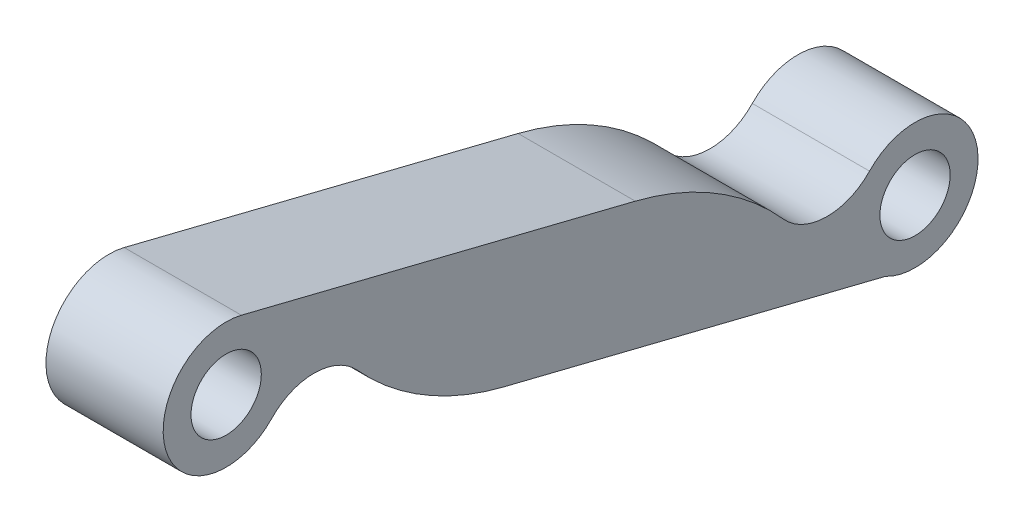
ISO-10303-21;
HEADER;
FILE_DESCRIPTION(('STEP AP214'),'2;1');
FILE_NAME('part.step','',(''),(''),'','','');
FILE_SCHEMA(('AUTOMOTIVE_DESIGN { 1 0 10303 214 1 1 1 1 }'));
ENDSEC;
DATA;
#1=APPLICATION_CONTEXT('core data for automotive mechanical design processes');
#2=APPLICATION_PROTOCOL_DEFINITION('international standard','automotive_design',2000,#1);
#3=PRODUCT_CONTEXT('',#1,'mechanical');
#4=PRODUCT('Part','Part','',(#3));
#5=PRODUCT_RELATED_PRODUCT_CATEGORY('part','',(#4));
#6=PRODUCT_DEFINITION_FORMATION('','',#4);
#7=PRODUCT_DEFINITION_CONTEXT('part definition',#1,'design');
#8=PRODUCT_DEFINITION('design','',#6,#7);
#9=PRODUCT_DEFINITION_SHAPE('','',#8);
#10=(LENGTH_UNIT() NAMED_UNIT(*) SI_UNIT(.MILLI.,.METRE.));
#11=(NAMED_UNIT(*) PLANE_ANGLE_UNIT() SI_UNIT($,.RADIAN.));
#12=(NAMED_UNIT(*) SI_UNIT($,.STERADIAN.) SOLID_ANGLE_UNIT());
#13=UNCERTAINTY_MEASURE_WITH_UNIT(LENGTH_MEASURE(1.E-05),#10,'distance_accuracy_value','');
#14=(GEOMETRIC_REPRESENTATION_CONTEXT(3) GLOBAL_UNCERTAINTY_ASSIGNED_CONTEXT((#13)) GLOBAL_UNIT_ASSIGNED_CONTEXT((#10,
#11,#12)) REPRESENTATION_CONTEXT('',''));
#15=CARTESIAN_POINT('',(0.,0.,0.));
#16=DIRECTION('',(0.,0.,1.));
#17=DIRECTION('',(1.,0.,0.));
#18=AXIS2_PLACEMENT_3D('',#15,#16,#17);
#19=CARTESIAN_POINT('',(-2.,-3.03108891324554,-26.340264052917));
#20=DIRECTION('',(1.,0.,0.));
#21=DIRECTION('',(0.,0.,-1.));
#22=AXIS2_PLACEMENT_3D('',#19,#20,#21);
#23=CYLINDRICAL_SURFACE('',#22,2.15);
#24=DIRECTION('',(1.,0.,0.));
#25=VECTOR('',#24,1.);
#26=CARTESIAN_POINT('',(-2.,-1.54552170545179,-24.7860471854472));
#27=LINE('',#26,#25);
#28=CARTESIAN_POINT('',(-2.,-1.54552170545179,-24.7860471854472));
#29=VERTEX_POINT('',#28);
#30=CARTESIAN_POINT('',(2.,-1.54552170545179,-24.7860471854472));
#31=VERTEX_POINT('',#30);
#32=EDGE_CURVE('E108',#29,#31,#27,.T.);
#33=ORIENTED_EDGE('',*,*,#32,.T.);
#34=CARTESIAN_POINT('',(2.,-3.03108891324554,-26.340264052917));
#35=DIRECTION('',(1.,0.,0.));
#36=DIRECTION('',(0.,0.,-1.));
#37=AXIS2_PLACEMENT_3D('',#34,#35,#36);
#38=CIRCLE('',#37,2.15);
#39=CARTESIAN_POINT('',(2.,-4.92963987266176,-25.3313020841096));
#40=VERTEX_POINT('',#39);
#41=EDGE_CURVE('E114',#40,#31,#38,.T.);
#42=ORIENTED_EDGE('',*,*,#41,.F.);
#43=DIRECTION('',(1.,0.,0.));
#44=VECTOR('',#43,1.);
#45=CARTESIAN_POINT('',(-2.,-4.92963987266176,-25.3313020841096));
#46=LINE('',#45,#44);
#47=CARTESIAN_POINT('',(-2.,-4.92963987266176,-25.3313020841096));
#48=VERTEX_POINT('',#47);
#49=EDGE_CURVE('E162',#48,#40,#46,.T.);
#50=ORIENTED_EDGE('',*,*,#49,.F.);
#51=CARTESIAN_POINT('',(-2.,-3.03108891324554,-26.340264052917));
#52=DIRECTION('',(1.,0.,0.));
#53=DIRECTION('',(0.,0.,-1.));
#54=AXIS2_PLACEMENT_3D('',#51,#52,#53);
#55=CIRCLE('',#54,2.15);
#56=EDGE_CURVE('E120',#48,#29,#55,.T.);
#57=ORIENTED_EDGE('',*,*,#56,.T.);
#58=EDGE_LOOP('',(#33,#42,#50,#57));
#59=FACE_BOUND('',#58,.T.);
#60=ADVANCED_FACE('F39',(#59),#23,.T.);
#61=CARTESIAN_POINT('',(-2.,1.30242376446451,-0.324584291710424));
#62=DIRECTION('',(0.,-0.970321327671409,0.24181919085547));
#63=DIRECTION('',(0.,-0.24181919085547,-0.970321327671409));
#64=AXIS2_PLACEMENT_3D('',#61,#62,#63);
#65=PLANE('',#64);
#66=DIRECTION('',(0.,-0.24181919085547,-0.970321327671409));
#67=VECTOR('',#66,1.);
#68=CARTESIAN_POINT('',(2.,1.30242376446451,-0.324584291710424));
#69=LINE('',#68,#67);
#70=CARTESIAN_POINT('',(2.,-1.68211993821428,-12.3003352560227));
#71=VERTEX_POINT('',#70);
#72=EDGE_CURVE('E128',#71,#40,#69,.T.);
#73=ORIENTED_EDGE('',*,*,#72,.F.);
#74=DIRECTION('',(-1.,0.,0.));
#75=VECTOR('',#74,1.);
#76=CARTESIAN_POINT('',(-2.,-1.68211993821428,-12.3003352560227));
#77=LINE('',#76,#75);
#78=CARTESIAN_POINT('',(-2.,-1.68211993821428,-12.3003352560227));
#79=VERTEX_POINT('',#78);
#80=EDGE_CURVE('E175',#71,#79,#77,.T.);
#81=ORIENTED_EDGE('',*,*,#80,.T.);
#82=DIRECTION('',(0.,-0.24181919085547,-0.970321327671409));
#83=VECTOR('',#82,1.);
#84=CARTESIAN_POINT('',(-2.,1.30242376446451,-0.324584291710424));
#85=LINE('',#84,#83);
#86=EDGE_CURVE('E158',#79,#48,#85,.T.);
#87=ORIENTED_EDGE('',*,*,#86,.T.);
#88=ORIENTED_EDGE('',*,*,#49,.T.);
#89=EDGE_LOOP('',(#73,#81,#87,#88));
#90=FACE_BOUND('',#89,.T.);
#91=ADVANCED_FACE('F193',(#90),#65,.T.);
#92=CARTESIAN_POINT('',(-2.,-0.0390630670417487,-5.8284271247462));
#93=DIRECTION('',(1.,0.,0.));
#94=DIRECTION('',(0.,0.,-1.));
#95=AXIS2_PLACEMENT_3D('',#92,#93,#94);
#96=CYLINDRICAL_SURFACE('',#95,2.);
#97=CARTESIAN_POINT('',(-2.,-0.0390630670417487,-5.8284271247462));
#98=DIRECTION('',(1.,0.,0.));
#99=DIRECTION('',(0.,0.,-1.));
#100=AXIS2_PLACEMENT_3D('',#97,#98,#99);
#101=CIRCLE('',#100,2.);
#102=CARTESIAN_POINT('',(-2.,1.30429633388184,-7.31011046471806));
#103=VERTEX_POINT('',#102);
#104=CARTESIAN_POINT('',(-2.,1.34285991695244,-4.38264399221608));
#105=VERTEX_POINT('',#104);
#106=EDGE_CURVE('E156',#103,#105,#101,.T.);
#107=ORIENTED_EDGE('',*,*,#106,.F.);
#108=DIRECTION('',(1.,0.,0.));
#109=VECTOR('',#108,1.);
#110=CARTESIAN_POINT('',(-2.,1.30429633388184,-7.31011046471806));
#111=LINE('',#110,#109);
#112=CARTESIAN_POINT('',(2.,1.30429633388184,-7.31011046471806));
#113=VERTEX_POINT('',#112);
#114=EDGE_CURVE('E164',#103,#113,#111,.T.);
#115=ORIENTED_EDGE('',*,*,#114,.T.);
#116=CARTESIAN_POINT('',(2.,-0.0390630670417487,-5.8284271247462));
#117=DIRECTION('',(1.,0.,0.));
#118=DIRECTION('',(0.,0.,-1.));
#119=AXIS2_PLACEMENT_3D('',#116,#117,#118);
#120=CIRCLE('',#119,2.);
#121=CARTESIAN_POINT('',(2.,1.34285991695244,-4.38264399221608));
#122=VERTEX_POINT('',#121);
#123=EDGE_CURVE('E139',#113,#122,#120,.T.);
#124=ORIENTED_EDGE('',*,*,#123,.T.);
#125=DIRECTION('',(1.,0.,0.));
#126=VECTOR('',#125,1.);
#127=CARTESIAN_POINT('',(-2.,1.34285991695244,-4.38264399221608));
#128=LINE('',#127,#126);
#129=EDGE_CURVE('E165',#105,#122,#128,.T.);
#130=ORIENTED_EDGE('',*,*,#129,.F.);
#131=EDGE_LOOP('',(#107,#115,#124,#130));
#132=FACE_BOUND('',#131,.T.);
#133=ADVANCED_FACE('F190',(#132),#96,.F.);
#134=CARTESIAN_POINT('',(-2.,2.82842712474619,-2.82842712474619));
#135=DIRECTION('',(1.,0.,0.));
#136=DIRECTION('',(0.,0.,-1.));
#137=AXIS2_PLACEMENT_3D('',#134,#135,#136);
#138=CYLINDRICAL_SURFACE('',#137,2.15);
#139=ORIENTED_EDGE('',*,*,#129,.T.);
#140=CARTESIAN_POINT('',(2.,2.82842712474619,-2.82842712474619));
#141=DIRECTION('',(1.,0.,0.));
#142=DIRECTION('',(0.,0.,-1.));
#143=AXIS2_PLACEMENT_3D('',#140,#141,#142);
#144=CIRCLE('',#143,2.15);
#145=CARTESIAN_POINT('',(2.,4.91461797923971,-3.34833838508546));
#146=VERTEX_POINT('',#145);
#147=EDGE_CURVE('E136',#146,#122,#144,.T.);
#148=ORIENTED_EDGE('',*,*,#147,.F.);
#149=DIRECTION('',(1.,0.,0.));
#150=VECTOR('',#149,1.);
#151=CARTESIAN_POINT('',(-2.,4.91461797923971,-3.34833838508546));
#152=LINE('',#151,#150);
#153=CARTESIAN_POINT('',(-2.,4.91461797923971,-3.34833838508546));
#154=VERTEX_POINT('',#153);
#155=EDGE_CURVE('E121',#154,#146,#152,.T.);
#156=ORIENTED_EDGE('',*,*,#155,.F.);
#157=CARTESIAN_POINT('',(-2.,2.82842712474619,-2.82842712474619));
#158=DIRECTION('',(1.,0.,0.));
#159=DIRECTION('',(0.,0.,-1.));
#160=AXIS2_PLACEMENT_3D('',#157,#158,#159);
#161=CIRCLE('',#160,2.15);
#162=EDGE_CURVE('E153',#154,#105,#161,.T.);
#163=ORIENTED_EDGE('',*,*,#162,.T.);
#164=EDGE_LOOP('',(#139,#148,#156,#163));
#165=FACE_BOUND('',#164,.T.);
#166=ADVANCED_FACE('F199',(#165),#138,.T.);
#167=CARTESIAN_POINT('',(-2.,5.41289009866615,-1.34897653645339));
#168=DIRECTION('',(0.,-0.970321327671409,0.24181919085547));
#169=DIRECTION('',(0.,-0.24181919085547,-0.970321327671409));
#170=AXIS2_PLACEMENT_3D('',#167,#168,#169);
#171=PLANE('',#170);
#172=DIRECTION('',(0.,-0.24181919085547,-0.970321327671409));
#173=VECTOR('',#172,1.);
#174=CARTESIAN_POINT('',(2.,5.41289009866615,-1.34897653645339));
#175=LINE('',#174,#173);
#176=CARTESIAN_POINT('',(2.,1.56418017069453,-16.7922724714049));
#177=VERTEX_POINT('',#176);
#178=EDGE_CURVE('E113',#146,#177,#175,.T.);
#179=ORIENTED_EDGE('',*,*,#178,.T.);
#180=DIRECTION('',(1.,0.,0.));
#181=VECTOR('',#180,1.);
#182=CARTESIAN_POINT('',(-2.,1.56418017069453,-16.7922724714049));
#183=LINE('',#182,#181);
#184=CARTESIAN_POINT('',(-2.,1.56418017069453,-16.7922724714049));
#185=VERTEX_POINT('',#184);
#186=EDGE_CURVE('E11',#177,#185,#183,.F.);
#187=ORIENTED_EDGE('',*,*,#186,.T.);
#188=DIRECTION('',(0.,-0.24181919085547,-0.970321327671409));
#189=VECTOR('',#188,1.);
#190=CARTESIAN_POINT('',(-2.,5.41289009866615,-1.34897653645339));
#191=LINE('',#190,#189);
#192=EDGE_CURVE('E151',#154,#185,#191,.T.);
#193=ORIENTED_EDGE('',*,*,#192,.F.);
#194=ORIENTED_EDGE('',*,*,#155,.T.);
#195=EDGE_LOOP('',(#179,#187,#193,#194));
#196=FACE_BOUND('',#195,.T.);
#197=ADVANCED_FACE('F196',(#196),#171,.F.);
#198=CARTESIAN_POINT('',(-2.,-0.163598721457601,-23.3402640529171));
#199=DIRECTION('',(1.,0.,0.));
#200=DIRECTION('',(0.,0.,-1.));
#201=AXIS2_PLACEMENT_3D('',#198,#199,#200);
#202=CYLINDRICAL_SURFACE('',#201,2.);
#203=CARTESIAN_POINT('',(-2.,-0.163598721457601,-23.3402640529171));
#204=DIRECTION('',(1.,0.,0.));
#205=DIRECTION('',(0.,0.,-1.));
#206=AXIS2_PLACEMENT_3D('',#203,#204,#205);
#207=CIRCLE('',#206,2.);
#208=CARTESIAN_POINT('',(-2.,-1.49283778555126,-21.8459001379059));
#209=VERTEX_POINT('',#208);
#210=EDGE_CURVE('E149',#209,#29,#207,.T.);
#211=ORIENTED_EDGE('',*,*,#210,.F.);
#212=DIRECTION('',(1.,0.,0.));
#213=VECTOR('',#212,1.);
#214=CARTESIAN_POINT('',(-2.,-1.49283778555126,-21.8459001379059));
#215=LINE('',#214,#213);
#216=CARTESIAN_POINT('',(2.,-1.49283778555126,-21.8459001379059));
#217=VERTEX_POINT('',#216);
#218=EDGE_CURVE('E47',#209,#217,#215,.T.);
#219=ORIENTED_EDGE('',*,*,#218,.T.);
#220=CARTESIAN_POINT('',(2.,-0.163598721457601,-23.3402640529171));
#221=DIRECTION('',(1.,0.,0.));
#222=DIRECTION('',(0.,0.,-1.));
#223=AXIS2_PLACEMENT_3D('',#220,#221,#222);
#224=CIRCLE('',#223,2.);
#225=EDGE_CURVE('E105',#217,#31,#224,.T.);
#226=ORIENTED_EDGE('',*,*,#225,.T.);
#227=ORIENTED_EDGE('',*,*,#32,.F.);
#228=EDGE_LOOP('',(#211,#219,#226,#227));
#229=FACE_BOUND('',#228,.T.);
#230=ADVANCED_FACE('F107',(#229),#202,.F.);
#231=CARTESIAN_POINT('',(-2.,-3.03108891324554,-26.340264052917));
#232=DIRECTION('',(1.,0.,0.));
#233=DIRECTION('',(0.,0.,-1.));
#234=AXIS2_PLACEMENT_3D('',#231,#232,#233);
#235=CYLINDRICAL_SURFACE('',#234,1.2);
#236=CARTESIAN_POINT('',(-2.,-3.03108891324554,-26.340264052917));
#237=DIRECTION('',(1.,0.,0.));
#238=DIRECTION('',(0.,0.,-1.));
#239=AXIS2_PLACEMENT_3D('',#236,#237,#238);
#240=CIRCLE('',#239,1.2);
#241=CARTESIAN_POINT('',(-2.,-3.03108891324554,-27.540264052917));
#242=VERTEX_POINT('',#241);
#243=EDGE_CURVE('E145',#242,#242,#240,.T.);
#244=ORIENTED_EDGE('',*,*,#243,.F.);
#245=EDGE_LOOP('',(#244));
#246=FACE_BOUND('',#245,.T.);
#247=CARTESIAN_POINT('',(2.,-3.03108891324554,-26.340264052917));
#248=DIRECTION('',(1.,0.,0.));
#249=DIRECTION('',(0.,0.,-1.));
#250=AXIS2_PLACEMENT_3D('',#247,#248,#249);
#251=CIRCLE('',#250,1.2);
#252=CARTESIAN_POINT('',(2.,-3.03108891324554,-27.540264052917));
#253=VERTEX_POINT('',#252);
#254=EDGE_CURVE('E130',#253,#253,#251,.T.);
#255=ORIENTED_EDGE('',*,*,#254,.T.);
#256=EDGE_LOOP('',(#255));
#257=FACE_BOUND('',#256,.T.);
#258=ADVANCED_FACE('F216',(#246,#257),#235,.F.);
#259=CARTESIAN_POINT('',(-2.,2.82842712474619,-2.82842712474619));
#260=DIRECTION('',(1.,0.,0.));
#261=DIRECTION('',(0.,0.,-1.));
#262=AXIS2_PLACEMENT_3D('',#259,#260,#261);
#263=CYLINDRICAL_SURFACE('',#262,1.2);
#264=CARTESIAN_POINT('',(-2.,2.82842712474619,-2.82842712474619));
#265=DIRECTION('',(1.,0.,0.));
#266=DIRECTION('',(0.,0.,-1.));
#267=AXIS2_PLACEMENT_3D('',#264,#265,#266);
#268=CIRCLE('',#267,1.2);
#269=CARTESIAN_POINT('',(-2.,2.82842712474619,-4.02842712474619));
#270=VERTEX_POINT('',#269);
#271=EDGE_CURVE('E122',#270,#270,#268,.T.);
#272=ORIENTED_EDGE('',*,*,#271,.F.);
#273=EDGE_LOOP('',(#272));
#274=FACE_BOUND('',#273,.T.);
#275=CARTESIAN_POINT('',(2.,2.82842712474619,-2.82842712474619));
#276=DIRECTION('',(1.,0.,0.));
#277=DIRECTION('',(0.,0.,-1.));
#278=AXIS2_PLACEMENT_3D('',#275,#276,#277);
#279=CIRCLE('',#278,1.2);
#280=CARTESIAN_POINT('',(2.,2.82842712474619,-4.02842712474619));
#281=VERTEX_POINT('',#280);
#282=EDGE_CURVE('E142',#281,#281,#279,.T.);
#283=ORIENTED_EDGE('',*,*,#282,.T.);
#284=EDGE_LOOP('',(#283));
#285=FACE_BOUND('',#284,.T.);
#286=ADVANCED_FACE('F218',(#274,#285),#263,.F.);
#287=CARTESIAN_POINT('',(-2.,0.,0.));
#288=DIRECTION('',(1.,0.,0.));
#289=DIRECTION('',(0.,0.,-1.));
#290=AXIS2_PLACEMENT_3D('',#287,#288,#289);
#291=PLANE('',#290);
#292=ORIENTED_EDGE('',*,*,#243,.T.);
#293=EDGE_LOOP('',(#292));
#294=FACE_BOUND('',#293,.T.);
#295=ORIENTED_EDGE('',*,*,#86,.F.);
#296=CARTESIAN_POINT('',(-2.,8.02109333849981,-14.7185271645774));
#297=DIRECTION('',(1.,0.,0.));
#298=DIRECTION('',(0.,0.,-1.));
#299=AXIS2_PLACEMENT_3D('',#296,#297,#298);
#300=CIRCLE('',#299,10.);
#301=EDGE_CURVE('E178',#79,#103,#300,.F.);
#302=ORIENTED_EDGE('',*,*,#301,.T.);
#303=ORIENTED_EDGE('',*,*,#106,.T.);
#304=ORIENTED_EDGE('',*,*,#162,.F.);
#305=ORIENTED_EDGE('',*,*,#192,.T.);
#306=CARTESIAN_POINT('',(-2.,-8.13903310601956,-14.3740805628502));
#307=DIRECTION('',(1.,0.,0.));
#308=DIRECTION('',(0.,0.,-1.));
#309=AXIS2_PLACEMENT_3D('',#306,#307,#308);
#310=CIRCLE('',#309,10.);
#311=EDGE_CURVE('E54',#185,#209,#310,.F.);
#312=ORIENTED_EDGE('',*,*,#311,.T.);
#313=ORIENTED_EDGE('',*,*,#210,.T.);
#314=ORIENTED_EDGE('',*,*,#56,.F.);
#315=EDGE_LOOP('',(#295,#302,#303,#304,#305,#312,#313,#314));
#316=FACE_BOUND('',#315,.T.);
#317=ORIENTED_EDGE('',*,*,#271,.T.);
#318=EDGE_LOOP('',(#317));
#319=FACE_BOUND('',#318,.T.);
#320=ADVANCED_FACE('F182',(#294,#316,#319),#291,.F.);
#321=CARTESIAN_POINT('',(2.,0.,0.));
#322=DIRECTION('',(1.,0.,0.));
#323=DIRECTION('',(0.,0.,-1.));
#324=AXIS2_PLACEMENT_3D('',#321,#322,#323);
#325=PLANE('',#324);
#326=ORIENTED_EDGE('',*,*,#254,.F.);
#327=EDGE_LOOP('',(#326));
#328=FACE_BOUND('',#327,.T.);
#329=ORIENTED_EDGE('',*,*,#123,.F.);
#330=CARTESIAN_POINT('',(2.,8.02109333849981,-14.7185271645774));
#331=DIRECTION('',(1.,0.,0.));
#332=DIRECTION('',(0.,0.,-1.));
#333=AXIS2_PLACEMENT_3D('',#330,#331,#332);
#334=CIRCLE('',#333,10.);
#335=EDGE_CURVE('E173',#113,#71,#334,.T.);
#336=ORIENTED_EDGE('',*,*,#335,.T.);
#337=ORIENTED_EDGE('',*,*,#72,.T.);
#338=ORIENTED_EDGE('',*,*,#41,.T.);
#339=ORIENTED_EDGE('',*,*,#225,.F.);
#340=CARTESIAN_POINT('',(2.,-8.13903310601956,-14.3740805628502));
#341=DIRECTION('',(1.,0.,0.));
#342=DIRECTION('',(0.,0.,-1.));
#343=AXIS2_PLACEMENT_3D('',#340,#341,#342);
#344=CIRCLE('',#343,10.);
#345=EDGE_CURVE('E171',#217,#177,#344,.T.);
#346=ORIENTED_EDGE('',*,*,#345,.T.);
#347=ORIENTED_EDGE('',*,*,#178,.F.);
#348=ORIENTED_EDGE('',*,*,#147,.T.);
#349=EDGE_LOOP('',(#329,#336,#337,#338,#339,#346,#347,#348));
#350=FACE_BOUND('',#349,.T.);
#351=ORIENTED_EDGE('',*,*,#282,.F.);
#352=EDGE_LOOP('',(#351));
#353=FACE_BOUND('',#352,.T.);
#354=ADVANCED_FACE('F125',(#328,#350,#353),#325,.T.);
#355=CARTESIAN_POINT('',(-2.,8.02109333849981,-14.7185271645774));
#356=DIRECTION('',(1.,0.,0.));
#357=DIRECTION('',(0.,0.,-1.));
#358=AXIS2_PLACEMENT_3D('',#355,#356,#357);
#359=CYLINDRICAL_SURFACE('',#358,10.);
#360=ORIENTED_EDGE('',*,*,#301,.F.);
#361=ORIENTED_EDGE('',*,*,#80,.F.);
#362=ORIENTED_EDGE('',*,*,#335,.F.);
#363=ORIENTED_EDGE('',*,*,#114,.F.);
#364=EDGE_LOOP('',(#360,#361,#362,#363));
#365=FACE_BOUND('',#364,.T.);
#366=ADVANCED_FACE('F191',(#365),#359,.T.);
#367=CARTESIAN_POINT('',(-2.,-8.13903310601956,-14.3740805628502));
#368=DIRECTION('',(1.,0.,0.));
#369=DIRECTION('',(0.,0.,-1.));
#370=AXIS2_PLACEMENT_3D('',#367,#368,#369);
#371=CYLINDRICAL_SURFACE('',#370,10.);
#372=ORIENTED_EDGE('',*,*,#311,.F.);
#373=ORIENTED_EDGE('',*,*,#186,.F.);
#374=ORIENTED_EDGE('',*,*,#345,.F.);
#375=ORIENTED_EDGE('',*,*,#218,.F.);
#376=EDGE_LOOP('',(#372,#373,#374,#375));
#377=FACE_BOUND('',#376,.T.);
#378=ADVANCED_FACE('F41',(#377),#371,.T.);
#379=CLOSED_SHELL('',(#60,#91,#133,#166,#197,#230,#258,#286,#320,#354,#366,#378));
#380=MANIFOLD_SOLID_BREP('B2',#379);
#381=ADVANCED_BREP_SHAPE_REPRESENTATION('',(#18,#380),#14);
#382=SHAPE_DEFINITION_REPRESENTATION(#9,#381);
ENDSEC;
END-ISO-10303-21;
